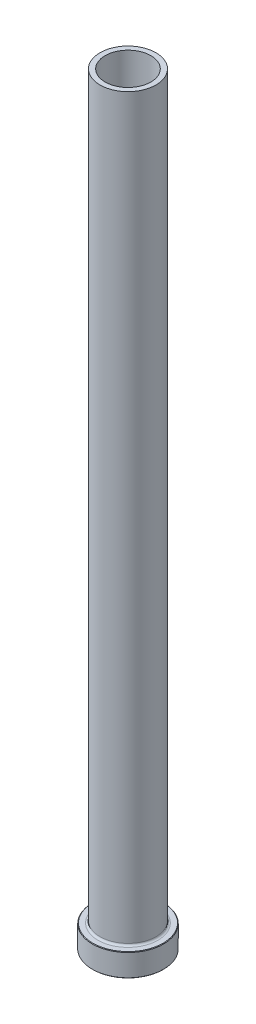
from build123d import *

# Parameters (mm, degrees)
FILLET1_R     = 0.8
CHAMFER1_SIZE = 0.2
CHAMFER3_SIZE = 0.5


with BuildPart() as part:
    # Sketch1 → Revolve1 (revolve)
    with BuildSketch(Plane.XY, mode=Mode.PRIVATE) as revolve1_sk:
        Polygon((-9, 300), (-11, 300), (-11, 9), (-14, 9), (-14, 0), (-9.25, 0), (-9.25, 233), (-9, 245), align=None)
    revolve(revolve1_sk.sketch.rotate(Axis((0, 92.187680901, 0), (0, -1, 0)), 270), axis=Axis((0, 92.187680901, 0), (0, -1, 0)))

    # Fillet1
    fillet1_edges = [part.edges().sort_by_distance(p)[0] for p in [
        (0, 9, -11),
    ]]
    fillet(fillet1_edges, radius=FILLET1_R)

    # Chamfer1
    chamfer1_edges = [part.edges().sort_by_distance(p)[0] for p in [
        (0, 0, -14),
        (0, 9, -14),
    ]]
    chamfer(chamfer1_edges, length=CHAMFER1_SIZE)

    # Chamfer3
    chamfer3_edges = [part.edges().sort_by_distance(p)[0] for p in [
        (0, 0, -9.25),
    ]]
    chamfer(chamfer3_edges, length=CHAMFER3_SIZE)


solid = part.part
